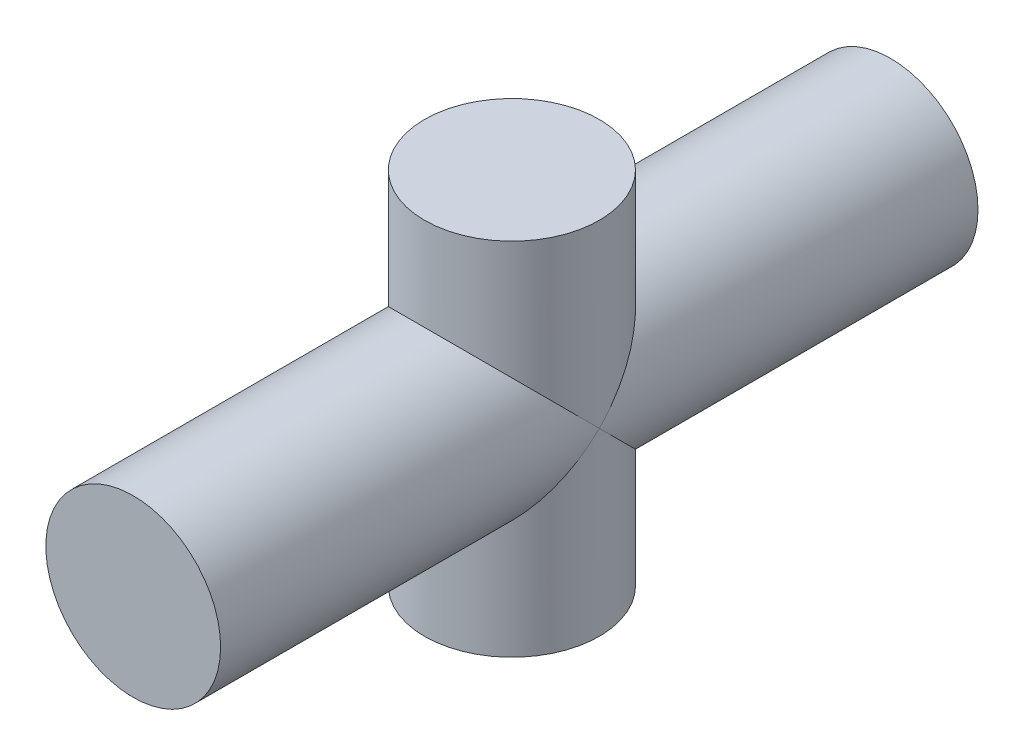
from build123d import *

# Parameters (mm, degrees)
ESQUISSE1_R      = 15
EXTRUSION1_DEPTH = 61.85
ESQUISSE2_R      = 15
EXTRUSION2_DEPTH = 65


with BuildPart() as part:
    # Esquisse1 → Extrusion1 (new body)
    with BuildSketch(Plane(origin=(0, 0, 0), x_dir=(1, 0, 0), z_dir=(0, 1, 0))):
        with Locations(Location((0, 0, 0), (0, 0, 270))):
            Circle(ESQUISSE1_R)
    extrude(amount=EXTRUSION1_DEPTH)

    # Esquisse2 → Extrusion2 (add, symmetric)
    with BuildSketch(Plane.XY):
        with Locations((0, 30.925)):
            Circle(ESQUISSE2_R)
    extrude(amount=EXTRUSION2_DEPTH, both=True)


solid = part.part
